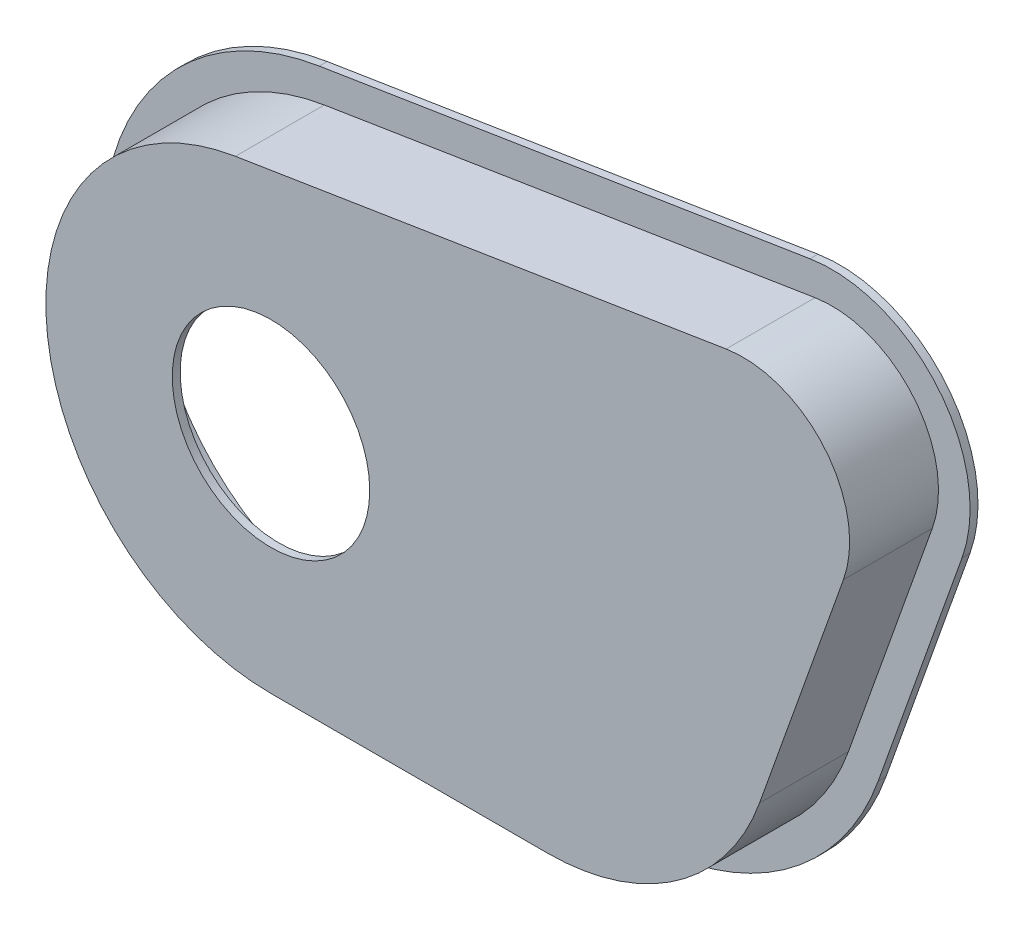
from build123d import *

# Parameters (mm, degrees)
BOSS_EXTRUDE1_DEPTH = 28.575
SKETCH4_R           = 31.75
BOSS_EXTRUDE4_DEPTH = 2.54
BOSS_EXTRUDE5_DEPTH = 2.54


with BuildPart() as part:
    # Sketch1 → Boss-Extrude1 (new body)
    with BuildSketch(Plane.XY):
        with BuildLine():
            Line((146.345280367, 96.72128919), (-11.434859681, 71.481158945))
            ThreePointArc((-11.434859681, 71.481158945), (-72.162432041, -5.735460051), (0, -72.39))
            Line((0, -72.39), (88.9, -72.39))
            ThreePointArc((88.9, -72.39), (130.616027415, -59.161517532), (157.08575735, -24.31079173))
            Line((157.08575735, -24.31079173), (184.060309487, 51.346154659))
            ThreePointArc((184.060309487, 51.346154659), (178.131970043, 84.780229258), (146.345280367, 96.72128919))
        make_face()
        with BuildLine():
            Line((-11.033636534, 68.973048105), (146.746503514, 94.21317835))
            ThreePointArc((146.746503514, 94.21317835), (176.178623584, 83.156641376), (181.667826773, 52.199164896))
            Line((181.667826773, 52.199164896), (154.693274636, -23.457781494))
            ThreePointArc((154.693274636, -23.457781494), (129.152307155, -57.085674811), (88.9, -69.85))
            Line((88.9, -69.85), (0, -69.85))
            ThreePointArc((0, -69.85), (-69.630416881, -5.534215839), (-11.033636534, 68.973048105))
        make_face(mode=Mode.SUBTRACT)
    extrude(amount=BOSS_EXTRUDE1_DEPTH)

    # Sketch4 → Boss-Extrude4 (add)
    with BuildSketch(Plane.XY.offset(28.575)):
        with BuildLine():
            Line((-11.434859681, 71.481158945), (146.345280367, 96.72128919))
            ThreePointArc((146.345280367, 96.72128919), (178.131970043, 84.780229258), (184.060309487, 51.346154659))
            Line((184.060309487, 51.346154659), (157.08575735, -24.31079173))
            ThreePointArc((157.08575735, -24.31079173), (130.616027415, -59.161517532), (88.9, -72.39))
            Line((88.9, -72.39), (0, -72.39))
            ThreePointArc((0, -72.39), (-72.162432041, -5.735460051), (-11.434859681, 71.481158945))
        make_face()
        Circle(SKETCH4_R, mode=Mode.SUBTRACT)
    extrude(amount=BOSS_EXTRUDE4_DEPTH)

    # Sketch5 → Boss-Extrude5 (add)
    with BuildSketch(Plane(origin=(0, 0, 0), x_dir=(-1, 0, 0), z_dir=(0, 0, -1))):
        with BuildLine():
            Line((-144.74038778, 106.75373255), (13.039752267, 81.513602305))
            ThreePointArc((13.039752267, 81.513602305), (82.290492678, -6.5404369), (0, -82.55))
            Line((0, -82.55), (-88.9, -82.55))
            ThreePointArc((-88.9, -82.55), (-136.470908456, -67.464888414), (-166.655688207, -27.722832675))
            Line((-166.655688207, -27.722832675), (-193.630240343, 47.934113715))
            ThreePointArc((-193.630240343, 47.934113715), (-185.945355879, 91.274580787), (-144.74038778, 106.75373255))
        make_face()
        with BuildLine():
            Line((-146.345280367, 96.72128919), (11.434859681, 71.481158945))
            ThreePointArc((11.434859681, 71.481158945), (72.162432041, -5.735460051), (0, -72.39))
            Line((0, -72.39), (-88.9, -72.39))
            ThreePointArc((-88.9, -72.39), (-130.616027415, -59.161517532), (-157.08575735, -24.31079173))
            Line((-157.08575735, -24.31079173), (-184.060309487, 51.346154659))
            ThreePointArc((-184.060309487, 51.346154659), (-178.131970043, 84.780229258), (-146.345280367, 96.72128919))
        make_face(mode=Mode.SUBTRACT)
    extrude(amount=-BOSS_EXTRUDE5_DEPTH)


solid = part.part
